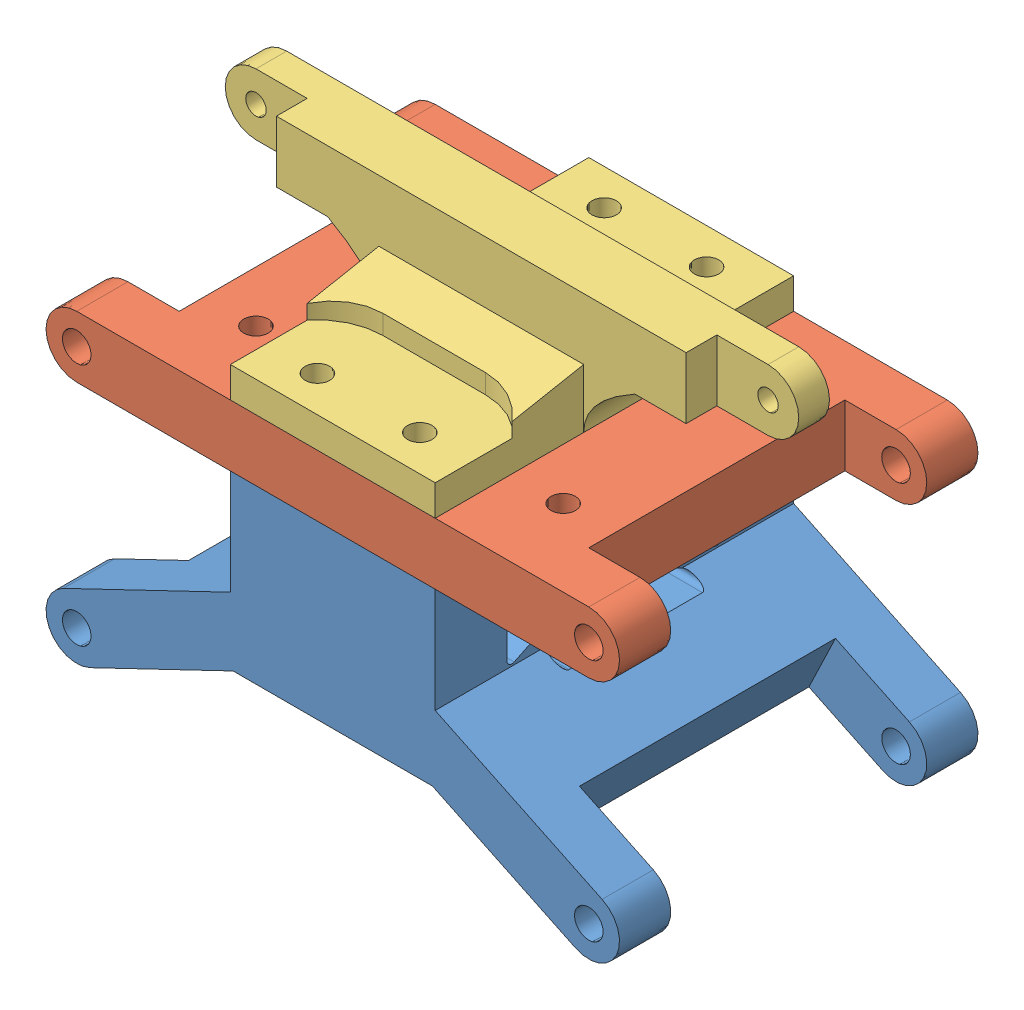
SolidWorks assembly Suspension MAIN Assembled.SLDASM, configuration Default (file format 10000). Lengths in mm.
Overall size (71.12 52.75 44.45).
3 component instances, 3 part files, 6 mates.
Components (placement in the parent):
- Suspention M. Part 1-1: Suspention M. Part 1.SLDPRT [Default] at (28.4505 47.8914 46.2645) size (71.12 32.74 44.45)
- Suspension M. Part 2-1: Suspension M. Part 2.SLDPRT [Default] at (28.4505 62.8551 46.2645) size (71.12 10.16 44.45)
- Shock Support 2-1: Shock Support 2.SLDPRT [Default] at (28.4505 66.6651 46.2645) size (71.12 14.92 44.45)
Mates (geometry in assembly coordinates):
- Concentric1: concentric aligned: cylinder of Suspention M. Part 1-1 through (22.1005 61.5851 64.0445) axis (0 -1 0) radius 2.54; cylinder of Suspension M. Part 2-1 through (22.1005 61.5851 64.0445) axis (0 -1 0) radius 2.54
- Concentric2: concentric aligned: cylinder of Suspention M. Part 1-1 through (22.1005 61.5851 28.4845) axis (0 -1 0) radius 2.54; cylinder of Suspension M. Part 2-1 through (22.1005 61.5851 28.4845) axis (0 -1 0) radius 2.54
- Coincident1: coincident anti-aligned: plane of Suspention M. Part 1-1 through (15.7505 59.0451 68.4895) normal (0 1 0); plane of Suspension M. Part 2-1 through (-3.2995 59.0451 68.4895) normal (0 -1 0)
- Concentric3: concentric aligned: cylinder of Suspension M. Part 2-1 through (28.4505 69.2051 55.7895) axis (0 -1 0) radius 2.54; cylinder of Shock Support 2-1 through (28.4505 69.2051 55.7895) axis (0 -1 0) radius 2.54
- Concentric4: concentric aligned: cylinder of Suspension M. Part 2-1 through (28.4505 69.2051 36.7395) axis (0 -1 0) radius 2.54; cylinder of Shock Support 2-1 through (28.4505 69.2051 36.7395) axis (0 -1 0) radius 2.54
- Coincident2: coincident anti-aligned: plane of Suspension M. Part 2-1 through (28.4505 69.2051 36.7395) normal (0 1 0); plane of Shock Support 2-1 through (28.4505 69.2051 36.7395) normal (0 -1 0)
